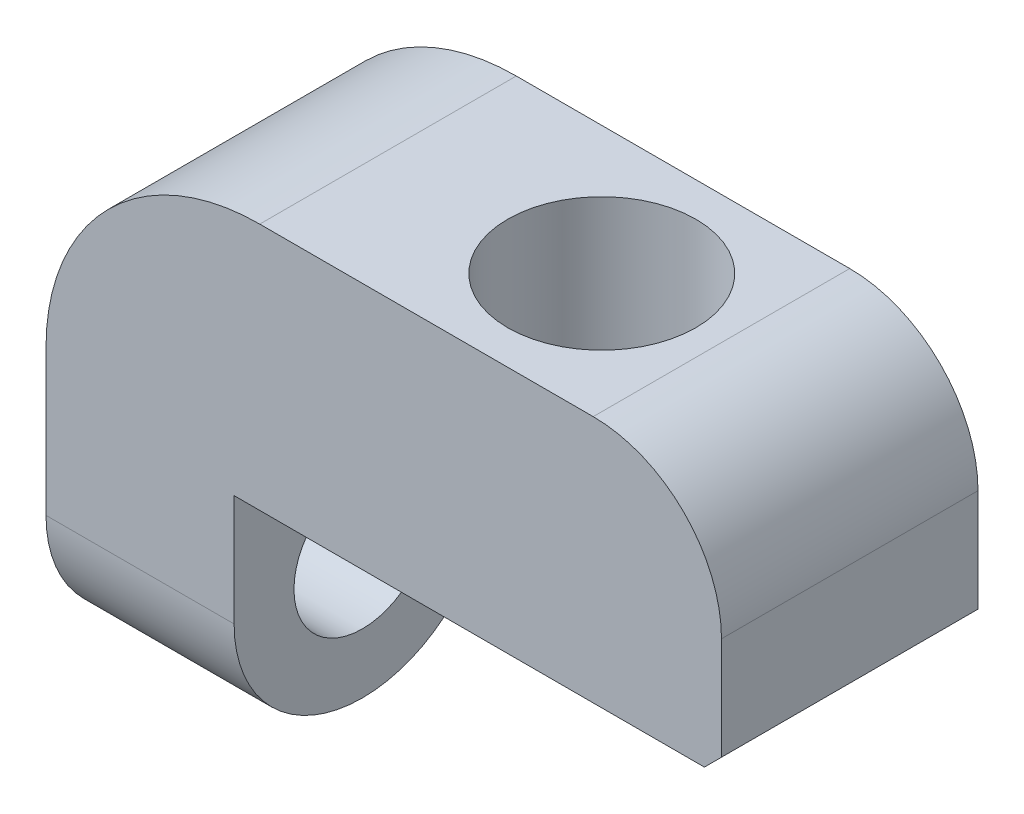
ISO-10303-21;
HEADER;
FILE_DESCRIPTION(('STEP AP214'),'2;1');
FILE_NAME('part.step','',(''),(''),'','','');
FILE_SCHEMA(('AUTOMOTIVE_DESIGN { 1 0 10303 214 1 1 1 1 }'));
ENDSEC;
DATA;
#1=APPLICATION_CONTEXT('core data for automotive mechanical design processes');
#2=APPLICATION_PROTOCOL_DEFINITION('international standard','automotive_design',2000,#1);
#3=PRODUCT_CONTEXT('',#1,'mechanical');
#4=PRODUCT('Part','Part','',(#3));
#5=PRODUCT_RELATED_PRODUCT_CATEGORY('part','',(#4));
#6=PRODUCT_DEFINITION_FORMATION('','',#4);
#7=PRODUCT_DEFINITION_CONTEXT('part definition',#1,'design');
#8=PRODUCT_DEFINITION('design','',#6,#7);
#9=PRODUCT_DEFINITION_SHAPE('','',#8);
#10=(LENGTH_UNIT() NAMED_UNIT(*) SI_UNIT(.MILLI.,.METRE.));
#11=(NAMED_UNIT(*) PLANE_ANGLE_UNIT() SI_UNIT($,.RADIAN.));
#12=(NAMED_UNIT(*) SI_UNIT($,.STERADIAN.) SOLID_ANGLE_UNIT());
#13=UNCERTAINTY_MEASURE_WITH_UNIT(LENGTH_MEASURE(1.E-05),#10,'distance_accuracy_value','');
#14=(GEOMETRIC_REPRESENTATION_CONTEXT(3) GLOBAL_UNCERTAINTY_ASSIGNED_CONTEXT((#13)) GLOBAL_UNIT_ASSIGNED_CONTEXT((#10,
#11,#12)) REPRESENTATION_CONTEXT('',''));
#15=CARTESIAN_POINT('',(0.,0.,0.));
#16=DIRECTION('',(0.,0.,1.));
#17=DIRECTION('',(1.,0.,0.));
#18=AXIS2_PLACEMENT_3D('',#15,#16,#17);
#19=CARTESIAN_POINT('',(65.5,31.5,24.));
#20=DIRECTION('',(0.,1.,0.));
#21=DIRECTION('',(0.,0.,1.));
#22=AXIS2_PLACEMENT_3D('',#19,#20,#21);
#23=PLANE('',#22);
#24=CARTESIAN_POINT('',(68.,31.5,24.));
#25=DIRECTION('',(0.,-1.,0.));
#26=DIRECTION('',(0.,0.,-1.));
#27=AXIS2_PLACEMENT_3D('',#24,#25,#26);
#28=CIRCLE('',#27,3.5);
#29=CARTESIAN_POINT('',(68.,31.5,20.5));
#30=VERTEX_POINT('',#29);
#31=EDGE_CURVE('E155',#30,#30,#28,.T.);
#32=ORIENTED_EDGE('',*,*,#31,.F.);
#33=EDGE_LOOP('',(#32));
#34=FACE_BOUND('',#33,.T.);
#35=CARTESIAN_POINT('',(51.,31.5,24.));
#36=DIRECTION('',(0.,-1.,0.));
#37=DIRECTION('',(0.,0.,-1.));
#38=AXIS2_PLACEMENT_3D('',#35,#36,#37);
#39=CIRCLE('',#38,11.);
#40=CARTESIAN_POINT('',(51.,31.5,13.));
#41=VERTEX_POINT('',#40);
#42=CARTESIAN_POINT('',(51.,31.5,35.));
#43=VERTEX_POINT('',#42);
#44=EDGE_CURVE('E165',#41,#43,#39,.T.);
#45=ORIENTED_EDGE('',*,*,#44,.F.);
#46=DIRECTION('',(1.,0.,0.));
#47=VECTOR('',#46,1.);
#48=CARTESIAN_POINT('',(65.5,31.5,13.));
#49=LINE('',#48,#47);
#50=CARTESIAN_POINT('',(65.5,31.5,13.));
#51=VERTEX_POINT('',#50);
#52=EDGE_CURVE('E191',#41,#51,#49,.T.);
#53=ORIENTED_EDGE('',*,*,#52,.T.);
#54=CARTESIAN_POINT('',(65.5,31.5,24.));
#55=DIRECTION('',(0.,-1.,0.));
#56=DIRECTION('',(0.,0.,1.));
#57=AXIS2_PLACEMENT_3D('',#54,#55,#56);
#58=CIRCLE('',#57,11.);
#59=CARTESIAN_POINT('',(65.5,31.5,35.));
#60=VERTEX_POINT('',#59);
#61=EDGE_CURVE('E181',#51,#60,#58,.T.);
#62=ORIENTED_EDGE('',*,*,#61,.T.);
#63=DIRECTION('',(-1.,0.,0.));
#64=VECTOR('',#63,1.);
#65=CARTESIAN_POINT('',(65.5,31.5,35.));
#66=LINE('',#65,#64);
#67=EDGE_CURVE('E185',#60,#43,#66,.T.);
#68=ORIENTED_EDGE('',*,*,#67,.T.);
#69=EDGE_LOOP('',(#45,#53,#62,#68));
#70=FACE_BOUND('',#69,.T.);
#71=ADVANCED_FACE('F29',(#34,#70),#23,.F.);
#72=CARTESIAN_POINT('',(34.,31.5,24.));
#73=DIRECTION('',(0.,-1.,0.));
#74=DIRECTION('',(0.,0.,-1.));
#75=AXIS2_PLACEMENT_3D('',#72,#73,#74);
#76=CIRCLE('',#75,3.5);
#77=CARTESIAN_POINT('',(34.,31.5,20.5));
#78=VERTEX_POINT('',#77);
#79=EDGE_CURVE('E148',#78,#78,#76,.T.);
#80=ORIENTED_EDGE('',*,*,#79,.F.);
#81=EDGE_LOOP('',(#80));
#82=FACE_BOUND('',#81,.T.);
#83=EDGE_CURVE('E164',#43,#41,#39,.T.);
#84=ORIENTED_EDGE('',*,*,#83,.F.);
#85=CARTESIAN_POINT('',(36.5,31.5,35.));
#86=VERTEX_POINT('',#85);
#87=EDGE_CURVE('E184',#43,#86,#66,.T.);
#88=ORIENTED_EDGE('',*,*,#87,.T.);
#89=CARTESIAN_POINT('',(36.5,31.5,24.));
#90=DIRECTION('',(0.,-1.,0.));
#91=DIRECTION('',(0.,0.,-1.));
#92=AXIS2_PLACEMENT_3D('',#89,#90,#91);
#93=CIRCLE('',#92,11.);
#94=CARTESIAN_POINT('',(36.5,31.5,13.));
#95=VERTEX_POINT('',#94);
#96=EDGE_CURVE('E188',#86,#95,#93,.T.);
#97=ORIENTED_EDGE('',*,*,#96,.T.);
#98=EDGE_CURVE('E192',#95,#41,#49,.T.);
#99=ORIENTED_EDGE('',*,*,#98,.T.);
#100=EDGE_LOOP('',(#84,#88,#97,#99));
#101=FACE_BOUND('',#100,.T.);
#102=ADVANCED_FACE('F311',(#82,#101),#23,.F.);
#103=CARTESIAN_POINT('',(-134.664238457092,60.7958037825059,9.));
#104=DIRECTION('',(0.,0.,1.));
#105=DIRECTION('',(0.,-1.,0.));
#106=AXIS2_PLACEMENT_3D('',#103,#104,#105);
#107=PLANE('',#106);
#108=DIRECTION('',(0.,-1.,0.));
#109=VECTOR('',#108,1.);
#110=CARTESIAN_POINT('',(80.,0.999999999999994,9.00000000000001));
#111=LINE('',#110,#109);
#112=CARTESIAN_POINT('',(80.,42.9999999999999,9.00000000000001));
#113=VERTEX_POINT('',#112);
#114=CARTESIAN_POINT('',(80.,31.,9.00000000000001));
#115=VERTEX_POINT('',#114);
#116=EDGE_CURVE('E242',#113,#115,#111,.T.);
#117=ORIENTED_EDGE('',*,*,#116,.T.);
#118=DIRECTION('',(-0.707106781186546,-0.707106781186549,0.));
#119=VECTOR('',#118,1.);
#120=CARTESIAN_POINT('',(78.,29.,9.00000000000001));
#121=LINE('',#120,#119);
#122=CARTESIAN_POINT('',(78.,29.,9.00000000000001));
#123=VERTEX_POINT('',#122);
#124=EDGE_CURVE('E12',#115,#123,#121,.T.);
#125=ORIENTED_EDGE('',*,*,#124,.T.);
#126=DIRECTION('',(1.,0.,0.));
#127=VECTOR('',#126,1.);
#128=CARTESIAN_POINT('',(82.2408482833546,29.,9.00000000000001));
#129=LINE('',#128,#127);
#130=CARTESIAN_POINT('',(23.,29.,9.00000000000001));
#131=VERTEX_POINT('',#130);
#132=EDGE_CURVE('E206',#131,#123,#129,.T.);
#133=ORIENTED_EDGE('',*,*,#132,.F.);
#134=DIRECTION('',(0.,1.,0.));
#135=VECTOR('',#134,1.);
#136=CARTESIAN_POINT('',(23.,-4.15393061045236,9.00000000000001));
#137=LINE('',#136,#135);
#138=CARTESIAN_POINT('',(23.,16.,9.00000000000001));
#139=VERTEX_POINT('',#138);
#140=EDGE_CURVE('E198',#139,#131,#137,.T.);
#141=ORIENTED_EDGE('',*,*,#140,.F.);
#142=DIRECTION('',(-1.,0.,0.));
#143=VECTOR('',#142,1.);
#144=CARTESIAN_POINT('',(1.,16.,9.00000000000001));
#145=LINE('',#144,#143);
#146=CARTESIAN_POINT('',(1.00000000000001,16.,9.00000000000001));
#147=VERTEX_POINT('',#146);
#148=EDGE_CURVE('E252',#139,#147,#145,.T.);
#149=ORIENTED_EDGE('',*,*,#148,.T.);
#150=DIRECTION('',(0.,1.,0.));
#151=VECTOR('',#150,1.);
#152=CARTESIAN_POINT('',(1.,32.9999999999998,9.00000000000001));
#153=LINE('',#152,#151);
#154=CARTESIAN_POINT('',(1.,32.9999999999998,9.00000000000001));
#155=VERTEX_POINT('',#154);
#156=EDGE_CURVE('E223',#147,#155,#153,.T.);
#157=ORIENTED_EDGE('',*,*,#156,.T.);
#158=CARTESIAN_POINT('',(26.,33.,9.00000000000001));
#159=DIRECTION('',(0.,0.,1.));
#160=DIRECTION('',(0.,-1.,0.));
#161=AXIS2_PLACEMENT_3D('',#158,#159,#160);
#162=CIRCLE('',#161,25.);
#163=CARTESIAN_POINT('',(26.0000000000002,58.,9.));
#164=VERTEX_POINT('',#163);
#165=EDGE_CURVE('E220',#155,#164,#162,.F.);
#166=ORIENTED_EDGE('',*,*,#165,.T.);
#167=DIRECTION('',(1.,0.,0.));
#168=VECTOR('',#167,1.);
#169=CARTESIAN_POINT('',(64.9999999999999,58.,9.));
#170=LINE('',#169,#168);
#171=CARTESIAN_POINT('',(64.9999999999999,58.,9.00000000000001));
#172=VERTEX_POINT('',#171);
#173=EDGE_CURVE('E217',#164,#172,#170,.T.);
#174=ORIENTED_EDGE('',*,*,#173,.T.);
#175=CARTESIAN_POINT('',(65.,43.,9.));
#176=DIRECTION('',(0.,0.,1.));
#177=DIRECTION('',(0.,-1.,0.));
#178=AXIS2_PLACEMENT_3D('',#175,#176,#177);
#179=CIRCLE('',#178,15.);
#180=EDGE_CURVE('E214',#172,#113,#179,.F.);
#181=ORIENTED_EDGE('',*,*,#180,.T.);
#182=EDGE_LOOP('',(#117,#125,#133,#141,#149,#157,#166,#174,#181));
#183=FACE_BOUND('',#182,.T.);
#184=ADVANCED_FACE('F298',(#183),#107,.F.);
#185=CARTESIAN_POINT('',(1.,32.9999999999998,8.));
#186=DIRECTION('',(-1.,0.,0.));
#187=DIRECTION('',(0.,-1.,0.));
#188=AXIS2_PLACEMENT_3D('',#185,#186,#187);
#189=PLANE('',#188);
#190=CARTESIAN_POINT('',(1.00000000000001,16.,24.));
#191=DIRECTION('',(-1.,0.,0.));
#192=DIRECTION('',(0.,-1.,0.));
#193=AXIS2_PLACEMENT_3D('',#190,#191,#192);
#194=CIRCLE('',#193,8.);
#195=CARTESIAN_POINT('',(1.00000000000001,7.99999999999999,24.));
#196=VERTEX_POINT('',#195);
#197=EDGE_CURVE('E270',#196,#196,#194,.T.);
#198=ORIENTED_EDGE('',*,*,#197,.F.);
#199=EDGE_LOOP('',(#198));
#200=FACE_BOUND('',#199,.T.);
#201=ORIENTED_EDGE('',*,*,#156,.F.);
#202=CARTESIAN_POINT('',(1.,16.,24.));
#203=DIRECTION('',(-1.,0.,0.));
#204=DIRECTION('',(0.,-1.,0.));
#205=AXIS2_PLACEMENT_3D('',#202,#203,#204);
#206=CIRCLE('',#205,15.);
#207=CARTESIAN_POINT('',(1.00000000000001,0.999999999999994,24.));
#208=VERTEX_POINT('',#207);
#209=EDGE_CURVE('E257',#147,#208,#206,.T.);
#210=ORIENTED_EDGE('',*,*,#209,.T.);
#211=CARTESIAN_POINT('',(1.00000000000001,16.,24.));
#212=DIRECTION('',(-1.,0.,0.));
#213=DIRECTION('',(0.,-1.,0.));
#214=AXIS2_PLACEMENT_3D('',#211,#212,#213);
#215=CIRCLE('',#214,15.);
#216=CARTESIAN_POINT('',(1.00000000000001,16.,39.));
#217=VERTEX_POINT('',#216);
#218=EDGE_CURVE('E255',#208,#217,#215,.T.);
#219=ORIENTED_EDGE('',*,*,#218,.T.);
#220=DIRECTION('',(0.,-1.,0.));
#221=VECTOR('',#220,1.);
#222=CARTESIAN_POINT('',(1.,32.9999999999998,39.));
#223=LINE('',#222,#221);
#224=CARTESIAN_POINT('',(1.,32.9999999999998,39.));
#225=VERTEX_POINT('',#224);
#226=EDGE_CURVE('E236',#225,#217,#223,.T.);
#227=ORIENTED_EDGE('',*,*,#226,.F.);
#228=DIRECTION('',(0.,0.,1.));
#229=VECTOR('',#228,1.);
#230=CARTESIAN_POINT('',(1.,32.9999999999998,8.));
#231=LINE('',#230,#229);
#232=EDGE_CURVE('E240',#155,#225,#231,.T.);
#233=ORIENTED_EDGE('',*,*,#232,.F.);
#234=EDGE_LOOP('',(#201,#210,#219,#227,#233));
#235=FACE_BOUND('',#234,.T.);
#236=ADVANCED_FACE('F348',(#200,#235),#189,.T.);
#237=CARTESIAN_POINT('',(26.,33.,8.));
#238=DIRECTION('',(0.,0.,1.));
#239=DIRECTION('',(1.,0.,0.));
#240=AXIS2_PLACEMENT_3D('',#237,#238,#239);
#241=CYLINDRICAL_SURFACE('',#240,25.);
#242=ORIENTED_EDGE('',*,*,#165,.F.);
#243=ORIENTED_EDGE('',*,*,#232,.T.);
#244=CARTESIAN_POINT('',(26.,33.,39.));
#245=DIRECTION('',(0.,0.,1.));
#246=DIRECTION('',(1.,0.,0.));
#247=AXIS2_PLACEMENT_3D('',#244,#245,#246);
#248=CIRCLE('',#247,25.);
#249=CARTESIAN_POINT('',(26.0000000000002,58.,39.));
#250=VERTEX_POINT('',#249);
#251=EDGE_CURVE('E233',#250,#225,#248,.T.);
#252=ORIENTED_EDGE('',*,*,#251,.F.);
#253=DIRECTION('',(0.,0.,1.));
#254=VECTOR('',#253,1.);
#255=CARTESIAN_POINT('',(26.0000000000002,58.,8.));
#256=LINE('',#255,#254);
#257=EDGE_CURVE('E243',#164,#250,#256,.T.);
#258=ORIENTED_EDGE('',*,*,#257,.F.);
#259=EDGE_LOOP('',(#242,#243,#252,#258));
#260=FACE_BOUND('',#259,.T.);
#261=ADVANCED_FACE('F351',(#260),#241,.T.);
#262=CARTESIAN_POINT('',(64.9999999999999,58.,8.));
#263=DIRECTION('',(0.,1.,0.));
#264=DIRECTION('',(-1.,0.,0.));
#265=AXIS2_PLACEMENT_3D('',#262,#263,#264);
#266=PLANE('',#265);
#267=CARTESIAN_POINT('',(51.,58.,24.));
#268=DIRECTION('',(0.,-1.,0.));
#269=DIRECTION('',(0.,0.,-1.));
#270=AXIS2_PLACEMENT_3D('',#267,#268,#269);
#271=CIRCLE('',#270,11.);
#272=CARTESIAN_POINT('',(51.,58.,13.));
#273=VERTEX_POINT('',#272);
#274=EDGE_CURVE('E167',#273,#273,#271,.T.);
#275=ORIENTED_EDGE('',*,*,#274,.T.);
#276=EDGE_LOOP('',(#275));
#277=FACE_BOUND('',#276,.T.);
#278=ORIENTED_EDGE('',*,*,#173,.F.);
#279=ORIENTED_EDGE('',*,*,#257,.T.);
#280=DIRECTION('',(-1.,0.,0.));
#281=VECTOR('',#280,1.);
#282=CARTESIAN_POINT('',(64.9999999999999,58.,39.));
#283=LINE('',#282,#281);
#284=CARTESIAN_POINT('',(64.9999999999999,58.,39.));
#285=VERTEX_POINT('',#284);
#286=EDGE_CURVE('E230',#285,#250,#283,.T.);
#287=ORIENTED_EDGE('',*,*,#286,.F.);
#288=DIRECTION('',(0.,0.,1.));
#289=VECTOR('',#288,1.);
#290=CARTESIAN_POINT('',(64.9999999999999,58.,8.));
#291=LINE('',#290,#289);
#292=EDGE_CURVE('E245',#172,#285,#291,.T.);
#293=ORIENTED_EDGE('',*,*,#292,.F.);
#294=EDGE_LOOP('',(#278,#279,#287,#293));
#295=FACE_BOUND('',#294,.T.);
#296=ADVANCED_FACE('F355',(#277,#295),#266,.T.);
#297=CARTESIAN_POINT('',(65.,43.,8.));
#298=DIRECTION('',(0.,0.,1.));
#299=DIRECTION('',(1.,0.,0.));
#300=AXIS2_PLACEMENT_3D('',#297,#298,#299);
#301=CYLINDRICAL_SURFACE('',#300,15.);
#302=ORIENTED_EDGE('',*,*,#180,.F.);
#303=ORIENTED_EDGE('',*,*,#292,.T.);
#304=CARTESIAN_POINT('',(65.,43.,39.));
#305=DIRECTION('',(0.,0.,1.));
#306=DIRECTION('',(1.,0.,0.));
#307=AXIS2_PLACEMENT_3D('',#304,#305,#306);
#308=CIRCLE('',#307,15.);
#309=CARTESIAN_POINT('',(80.,42.9999999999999,39.));
#310=VERTEX_POINT('',#309);
#311=EDGE_CURVE('E227',#310,#285,#308,.T.);
#312=ORIENTED_EDGE('',*,*,#311,.F.);
#313=DIRECTION('',(0.,0.,1.));
#314=VECTOR('',#313,1.);
#315=CARTESIAN_POINT('',(80.,42.9999999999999,8.));
#316=LINE('',#315,#314);
#317=EDGE_CURVE('E239',#113,#310,#316,.T.);
#318=ORIENTED_EDGE('',*,*,#317,.F.);
#319=EDGE_LOOP('',(#302,#303,#312,#318));
#320=FACE_BOUND('',#319,.T.);
#321=ADVANCED_FACE('F359',(#320),#301,.T.);
#322=CARTESIAN_POINT('',(80.,0.999999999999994,8.));
#323=DIRECTION('',(1.,0.,0.));
#324=DIRECTION('',(0.,0.,-1.));
#325=AXIS2_PLACEMENT_3D('',#322,#323,#324);
#326=PLANE('',#325);
#327=DIRECTION('',(0.,1.,0.));
#328=VECTOR('',#327,1.);
#329=CARTESIAN_POINT('',(80.,0.999999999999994,39.));
#330=LINE('',#329,#328);
#331=CARTESIAN_POINT('',(80.,31.,39.));
#332=VERTEX_POINT('',#331);
#333=EDGE_CURVE('E225',#332,#310,#330,.T.);
#334=ORIENTED_EDGE('',*,*,#333,.F.);
#335=DIRECTION('',(0.,0.,-1.));
#336=VECTOR('',#335,1.);
#337=CARTESIAN_POINT('',(80.,31.,9.00000000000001));
#338=LINE('',#337,#336);
#339=EDGE_CURVE('E37',#332,#115,#338,.T.);
#340=ORIENTED_EDGE('',*,*,#339,.T.);
#341=ORIENTED_EDGE('',*,*,#116,.F.);
#342=ORIENTED_EDGE('',*,*,#317,.T.);
#343=EDGE_LOOP('',(#334,#340,#341,#342));
#344=FACE_BOUND('',#343,.T.);
#345=ADVANCED_FACE('F362',(#344),#326,.T.);
#346=CARTESIAN_POINT('',(0.,59.,39.));
#347=DIRECTION('',(0.,0.,-1.));
#348=DIRECTION('',(-1.,0.,0.));
#349=AXIS2_PLACEMENT_3D('',#346,#347,#348);
#350=PLANE('',#349);
#351=DIRECTION('',(1.,0.,0.));
#352=VECTOR('',#351,1.);
#353=CARTESIAN_POINT('',(82.2408482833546,29.,39.));
#354=LINE('',#353,#352);
#355=CARTESIAN_POINT('',(23.,29.,39.));
#356=VERTEX_POINT('',#355);
#357=CARTESIAN_POINT('',(78.,29.,39.));
#358=VERTEX_POINT('',#357);
#359=EDGE_CURVE('E209',#356,#358,#354,.T.);
#360=ORIENTED_EDGE('',*,*,#359,.T.);
#361=DIRECTION('',(0.707106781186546,0.707106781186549,0.));
#362=VECTOR('',#361,1.);
#363=CARTESIAN_POINT('',(78.,29.,39.));
#364=LINE('',#363,#362);
#365=EDGE_CURVE('E51',#358,#332,#364,.T.);
#366=ORIENTED_EDGE('',*,*,#365,.T.);
#367=ORIENTED_EDGE('',*,*,#333,.T.);
#368=ORIENTED_EDGE('',*,*,#311,.T.);
#369=ORIENTED_EDGE('',*,*,#286,.T.);
#370=ORIENTED_EDGE('',*,*,#251,.T.);
#371=ORIENTED_EDGE('',*,*,#226,.T.);
#372=DIRECTION('',(1.,0.,0.));
#373=VECTOR('',#372,1.);
#374=CARTESIAN_POINT('',(23.,16.,39.));
#375=LINE('',#374,#373);
#376=CARTESIAN_POINT('',(23.,16.,39.));
#377=VERTEX_POINT('',#376);
#378=EDGE_CURVE('E263',#217,#377,#375,.T.);
#379=ORIENTED_EDGE('',*,*,#378,.T.);
#380=DIRECTION('',(0.,1.,0.));
#381=VECTOR('',#380,1.);
#382=CARTESIAN_POINT('',(23.,59.,39.));
#383=LINE('',#382,#381);
#384=EDGE_CURVE('E250',#377,#356,#383,.T.);
#385=ORIENTED_EDGE('',*,*,#384,.T.);
#386=EDGE_LOOP('',(#360,#366,#367,#368,#369,#370,#371,#379,#385));
#387=FACE_BOUND('',#386,.T.);
#388=ADVANCED_FACE('F31',(#387),#350,.F.);
#389=CARTESIAN_POINT('',(82.2408482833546,29.,39.));
#390=DIRECTION('',(0.,1.,0.));
#391=DIRECTION('',(0.,0.,1.));
#392=AXIS2_PLACEMENT_3D('',#389,#390,#391);
#393=PLANE('',#392);
#394=DIRECTION('',(-1.,0.,0.));
#395=VECTOR('',#394,1.);
#396=CARTESIAN_POINT('',(65.5,29.,35.));
#397=LINE('',#396,#395);
#398=CARTESIAN_POINT('',(65.5,29.,35.));
#399=VERTEX_POINT('',#398);
#400=CARTESIAN_POINT('',(36.5,29.,35.));
#401=VERTEX_POINT('',#400);
#402=EDGE_CURVE('E172',#399,#401,#397,.T.);
#403=ORIENTED_EDGE('',*,*,#402,.F.);
#404=CARTESIAN_POINT('',(65.5,29.,24.));
#405=DIRECTION('',(0.,-1.,0.));
#406=DIRECTION('',(0.,0.,1.));
#407=AXIS2_PLACEMENT_3D('',#404,#405,#406);
#408=CIRCLE('',#407,11.);
#409=CARTESIAN_POINT('',(65.5,29.,13.));
#410=VERTEX_POINT('',#409);
#411=EDGE_CURVE('E170',#410,#399,#408,.T.);
#412=ORIENTED_EDGE('',*,*,#411,.F.);
#413=DIRECTION('',(1.,0.,0.));
#414=VECTOR('',#413,1.);
#415=CARTESIAN_POINT('',(65.5,29.,13.));
#416=LINE('',#415,#414);
#417=CARTESIAN_POINT('',(36.5,29.,13.));
#418=VERTEX_POINT('',#417);
#419=EDGE_CURVE('E178',#418,#410,#416,.T.);
#420=ORIENTED_EDGE('',*,*,#419,.F.);
#421=CARTESIAN_POINT('',(36.5,29.,24.));
#422=DIRECTION('',(0.,-1.,0.));
#423=DIRECTION('',(0.,0.,-1.));
#424=AXIS2_PLACEMENT_3D('',#421,#422,#423);
#425=CIRCLE('',#424,11.);
#426=EDGE_CURVE('E175',#401,#418,#425,.T.);
#427=ORIENTED_EDGE('',*,*,#426,.F.);
#428=EDGE_LOOP('',(#403,#412,#420,#427));
#429=FACE_BOUND('',#428,.T.);
#430=ORIENTED_EDGE('',*,*,#132,.T.);
#431=DIRECTION('',(0.,0.,1.));
#432=VECTOR('',#431,1.);
#433=CARTESIAN_POINT('',(78.,29.,39.));
#434=LINE('',#433,#432);
#435=EDGE_CURVE('E265',#123,#358,#434,.T.);
#436=ORIENTED_EDGE('',*,*,#435,.T.);
#437=ORIENTED_EDGE('',*,*,#359,.F.);
#438=DIRECTION('',(0.,0.,-1.));
#439=VECTOR('',#438,1.);
#440=CARTESIAN_POINT('',(23.,29.,39.));
#441=LINE('',#440,#439);
#442=EDGE_CURVE('E211',#356,#131,#441,.T.);
#443=ORIENTED_EDGE('',*,*,#442,.T.);
#444=EDGE_LOOP('',(#430,#436,#437,#443));
#445=FACE_BOUND('',#444,.T.);
#446=ADVANCED_FACE('F276',(#429,#445),#393,.F.);
#447=CARTESIAN_POINT('',(23.,-4.15393061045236,39.));
#448=DIRECTION('',(-1.,0.,0.));
#449=DIRECTION('',(0.,0.,1.));
#450=AXIS2_PLACEMENT_3D('',#447,#448,#449);
#451=PLANE('',#450);
#452=CARTESIAN_POINT('',(23.,16.,24.));
#453=DIRECTION('',(-1.,0.,0.));
#454=DIRECTION('',(0.,0.,1.));
#455=AXIS2_PLACEMENT_3D('',#452,#453,#454);
#456=CIRCLE('',#455,8.);
#457=CARTESIAN_POINT('',(23.,16.,32.));
#458=VERTEX_POINT('',#457);
#459=EDGE_CURVE('E266',#458,#458,#456,.T.);
#460=ORIENTED_EDGE('',*,*,#459,.T.);
#461=EDGE_LOOP('',(#460));
#462=FACE_BOUND('',#461,.T.);
#463=CARTESIAN_POINT('',(23.,16.,24.));
#464=DIRECTION('',(-1.,0.,0.));
#465=DIRECTION('',(0.,0.,1.));
#466=AXIS2_PLACEMENT_3D('',#463,#464,#465);
#467=CIRCLE('',#466,15.);
#468=CARTESIAN_POINT('',(23.,0.999999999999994,24.));
#469=VERTEX_POINT('',#468);
#470=EDGE_CURVE('E259',#377,#469,#467,.F.);
#471=ORIENTED_EDGE('',*,*,#470,.T.);
#472=CARTESIAN_POINT('',(23.,16.,24.));
#473=DIRECTION('',(-1.,0.,0.));
#474=DIRECTION('',(0.,0.,1.));
#475=AXIS2_PLACEMENT_3D('',#472,#473,#474);
#476=CIRCLE('',#475,15.);
#477=EDGE_CURVE('E261',#469,#139,#476,.F.);
#478=ORIENTED_EDGE('',*,*,#477,.T.);
#479=ORIENTED_EDGE('',*,*,#140,.T.);
#480=ORIENTED_EDGE('',*,*,#442,.F.);
#481=ORIENTED_EDGE('',*,*,#384,.F.);
#482=EDGE_LOOP('',(#471,#478,#479,#480,#481));
#483=FACE_BOUND('',#482,.T.);
#484=ADVANCED_FACE('F285',(#462,#483),#451,.F.);
#485=CARTESIAN_POINT('',(65.5,31.5,24.));
#486=DIRECTION('',(0.,-1.,0.));
#487=DIRECTION('',(0.,0.,-1.));
#488=AXIS2_PLACEMENT_3D('',#485,#486,#487);
#489=CYLINDRICAL_SURFACE('',#488,11.);
#490=ORIENTED_EDGE('',*,*,#411,.T.);
#491=DIRECTION('',(0.,-1.,0.));
#492=VECTOR('',#491,1.);
#493=CARTESIAN_POINT('',(65.5,31.5,35.));
#494=LINE('',#493,#492);
#495=EDGE_CURVE('E195',#60,#399,#494,.T.);
#496=ORIENTED_EDGE('',*,*,#495,.F.);
#497=ORIENTED_EDGE('',*,*,#61,.F.);
#498=DIRECTION('',(0.,-1.,0.));
#499=VECTOR('',#498,1.);
#500=CARTESIAN_POINT('',(65.5,31.5,13.));
#501=LINE('',#500,#499);
#502=EDGE_CURVE('E196',#51,#410,#501,.T.);
#503=ORIENTED_EDGE('',*,*,#502,.T.);
#504=EDGE_LOOP('',(#490,#496,#497,#503));
#505=FACE_BOUND('',#504,.T.);
#506=ADVANCED_FACE('F329',(#505),#489,.F.);
#507=CARTESIAN_POINT('',(65.5,31.5,13.));
#508=DIRECTION('',(0.,0.,-1.));
#509=DIRECTION('',(-1.,0.,0.));
#510=AXIS2_PLACEMENT_3D('',#507,#508,#509);
#511=PLANE('',#510);
#512=ORIENTED_EDGE('',*,*,#419,.T.);
#513=ORIENTED_EDGE('',*,*,#502,.F.);
#514=ORIENTED_EDGE('',*,*,#52,.F.);
#515=ORIENTED_EDGE('',*,*,#98,.F.);
#516=DIRECTION('',(0.,-1.,0.));
#517=VECTOR('',#516,1.);
#518=CARTESIAN_POINT('',(36.5,31.5,13.));
#519=LINE('',#518,#517);
#520=EDGE_CURVE('E199',#95,#418,#519,.T.);
#521=ORIENTED_EDGE('',*,*,#520,.T.);
#522=EDGE_LOOP('',(#512,#513,#514,#515,#521));
#523=FACE_BOUND('',#522,.T.);
#524=ADVANCED_FACE('F325',(#523),#511,.F.);
#525=CARTESIAN_POINT('',(36.5,31.5,24.));
#526=DIRECTION('',(0.,-1.,0.));
#527=DIRECTION('',(0.,0.,-1.));
#528=AXIS2_PLACEMENT_3D('',#525,#526,#527);
#529=CYLINDRICAL_SURFACE('',#528,11.);
#530=ORIENTED_EDGE('',*,*,#426,.T.);
#531=ORIENTED_EDGE('',*,*,#520,.F.);
#532=ORIENTED_EDGE('',*,*,#96,.F.);
#533=DIRECTION('',(0.,-1.,0.));
#534=VECTOR('',#533,1.);
#535=CARTESIAN_POINT('',(36.5,31.5,35.));
#536=LINE('',#535,#534);
#537=EDGE_CURVE('E201',#86,#401,#536,.T.);
#538=ORIENTED_EDGE('',*,*,#537,.T.);
#539=EDGE_LOOP('',(#530,#531,#532,#538));
#540=FACE_BOUND('',#539,.T.);
#541=ADVANCED_FACE('F328',(#540),#529,.F.);
#542=CARTESIAN_POINT('',(65.5,31.5,35.));
#543=DIRECTION('',(0.,0.,1.));
#544=DIRECTION('',(1.,0.,0.));
#545=AXIS2_PLACEMENT_3D('',#542,#543,#544);
#546=PLANE('',#545);
#547=ORIENTED_EDGE('',*,*,#402,.T.);
#548=ORIENTED_EDGE('',*,*,#537,.F.);
#549=ORIENTED_EDGE('',*,*,#87,.F.);
#550=ORIENTED_EDGE('',*,*,#67,.F.);
#551=ORIENTED_EDGE('',*,*,#495,.T.);
#552=EDGE_LOOP('',(#547,#548,#549,#550,#551));
#553=FACE_BOUND('',#552,.T.);
#554=ADVANCED_FACE('F333',(#553),#546,.F.);
#555=CARTESIAN_POINT('',(51.,58.,24.));
#556=DIRECTION('',(0.,-1.,0.));
#557=DIRECTION('',(0.,0.,-1.));
#558=AXIS2_PLACEMENT_3D('',#555,#556,#557);
#559=CYLINDRICAL_SURFACE('',#558,11.);
#560=ORIENTED_EDGE('',*,*,#274,.F.);
#561=EDGE_LOOP('',(#560));
#562=FACE_BOUND('',#561,.T.);
#563=ORIENTED_EDGE('',*,*,#44,.T.);
#564=ORIENTED_EDGE('',*,*,#83,.T.);
#565=EDGE_LOOP('',(#563,#564));
#566=FACE_BOUND('',#565,.T.);
#567=ADVANCED_FACE('F323',(#562,#566),#559,.F.);
#568=CARTESIAN_POINT('',(34.,48.6,24.));
#569=DIRECTION('',(0.,-1.,0.));
#570=DIRECTION('',(0.,0.,-1.));
#571=AXIS2_PLACEMENT_3D('',#568,#569,#570);
#572=CONICAL_SURFACE('',#571,1.64999999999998,1.02974425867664);
#573=CARTESIAN_POINT('',(34.,49.5914200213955,24.));
#574=VERTEX_POINT('',#573);
#575=VERTEX_LOOP('',#574);
#576=FACE_BOUND('',#575,.T.);
#577=CARTESIAN_POINT('',(34.,48.6,24.));
#578=DIRECTION('',(0.,-1.,0.));
#579=DIRECTION('',(0.,0.,-1.));
#580=AXIS2_PLACEMENT_3D('',#577,#578,#579);
#581=CIRCLE('',#580,1.64999999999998);
#582=CARTESIAN_POINT('',(34.,48.6,22.35));
#583=VERTEX_POINT('',#582);
#584=EDGE_CURVE('E161',#583,#583,#581,.T.);
#585=ORIENTED_EDGE('',*,*,#584,.T.);
#586=EDGE_LOOP('',(#585));
#587=FACE_BOUND('',#586,.T.);
#588=ADVANCED_FACE('F422',(#576,#587),#572,.F.);
#589=CARTESIAN_POINT('',(34.,31.5,24.));
#590=DIRECTION('',(0.,-1.,0.));
#591=DIRECTION('',(0.,0.,-1.));
#592=AXIS2_PLACEMENT_3D('',#589,#590,#591);
#593=CYLINDRICAL_SURFACE('',#592,1.64999999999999);
#594=ORIENTED_EDGE('',*,*,#584,.F.);
#595=EDGE_LOOP('',(#594));
#596=FACE_BOUND('',#595,.T.);
#597=CARTESIAN_POINT('',(34.,33.35,24.));
#598=DIRECTION('',(0.,-1.,0.));
#599=DIRECTION('',(0.,0.,-1.));
#600=AXIS2_PLACEMENT_3D('',#597,#598,#599);
#601=CIRCLE('',#600,1.65);
#602=CARTESIAN_POINT('',(34.,33.35,22.35));
#603=VERTEX_POINT('',#602);
#604=EDGE_CURVE('E152',#603,#603,#601,.T.);
#605=ORIENTED_EDGE('',*,*,#604,.T.);
#606=EDGE_LOOP('',(#605));
#607=FACE_BOUND('',#606,.T.);
#608=ADVANCED_FACE('F428',(#596,#607),#593,.F.);
#609=CARTESIAN_POINT('',(34.,31.5,24.));
#610=DIRECTION('',(0.,-1.,0.));
#611=DIRECTION('',(0.,0.,-1.));
#612=AXIS2_PLACEMENT_3D('',#609,#610,#611);
#613=CONICAL_SURFACE('',#612,3.5,0.78539816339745);
#614=ORIENTED_EDGE('',*,*,#604,.F.);
#615=EDGE_LOOP('',(#614));
#616=FACE_BOUND('',#615,.T.);
#617=ORIENTED_EDGE('',*,*,#79,.T.);
#618=EDGE_LOOP('',(#617));
#619=FACE_BOUND('',#618,.T.);
#620=ADVANCED_FACE('F142',(#616,#619),#613,.F.);
#621=CARTESIAN_POINT('',(68.,48.6,24.));
#622=DIRECTION('',(0.,-1.,0.));
#623=DIRECTION('',(0.,0.,-1.));
#624=AXIS2_PLACEMENT_3D('',#621,#622,#623);
#625=CONICAL_SURFACE('',#624,1.64999999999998,1.02974425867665);
#626=CARTESIAN_POINT('',(68.,49.5914200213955,24.));
#627=VERTEX_POINT('',#626);
#628=VERTEX_LOOP('',#627);
#629=FACE_BOUND('',#628,.T.);
#630=CARTESIAN_POINT('',(68.,48.6,24.));
#631=DIRECTION('',(0.,-1.,0.));
#632=DIRECTION('',(0.,0.,-1.));
#633=AXIS2_PLACEMENT_3D('',#630,#631,#632);
#634=CIRCLE('',#633,1.64999999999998);
#635=CARTESIAN_POINT('',(68.,48.6,22.35));
#636=VERTEX_POINT('',#635);
#637=EDGE_CURVE('E146',#636,#636,#634,.T.);
#638=ORIENTED_EDGE('',*,*,#637,.T.);
#639=EDGE_LOOP('',(#638));
#640=FACE_BOUND('',#639,.T.);
#641=ADVANCED_FACE('F138',(#629,#640),#625,.F.);
#642=CARTESIAN_POINT('',(68.,31.5,24.));
#643=DIRECTION('',(0.,-1.,0.));
#644=DIRECTION('',(0.,0.,-1.));
#645=AXIS2_PLACEMENT_3D('',#642,#643,#644);
#646=CYLINDRICAL_SURFACE('',#645,1.64999999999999);
#647=ORIENTED_EDGE('',*,*,#637,.F.);
#648=EDGE_LOOP('',(#647));
#649=FACE_BOUND('',#648,.T.);
#650=CARTESIAN_POINT('',(68.,33.35,24.));
#651=DIRECTION('',(0.,-1.,0.));
#652=DIRECTION('',(0.,0.,-1.));
#653=AXIS2_PLACEMENT_3D('',#650,#651,#652);
#654=CIRCLE('',#653,1.65);
#655=CARTESIAN_POINT('',(68.,33.35,22.35));
#656=VERTEX_POINT('',#655);
#657=EDGE_CURVE('E149',#656,#656,#654,.T.);
#658=ORIENTED_EDGE('',*,*,#657,.T.);
#659=EDGE_LOOP('',(#658));
#660=FACE_BOUND('',#659,.T.);
#661=ADVANCED_FACE('F141',(#649,#660),#646,.F.);
#662=CARTESIAN_POINT('',(68.,31.5,24.));
#663=DIRECTION('',(0.,-1.,0.));
#664=DIRECTION('',(0.,0.,-1.));
#665=AXIS2_PLACEMENT_3D('',#662,#663,#664);
#666=CONICAL_SURFACE('',#665,3.5,0.78539816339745);
#667=ORIENTED_EDGE('',*,*,#657,.F.);
#668=EDGE_LOOP('',(#667));
#669=FACE_BOUND('',#668,.T.);
#670=ORIENTED_EDGE('',*,*,#31,.T.);
#671=EDGE_LOOP('',(#670));
#672=FACE_BOUND('',#671,.T.);
#673=ADVANCED_FACE('F455',(#669,#672),#666,.F.);
#674=CARTESIAN_POINT('',(0.,16.,24.));
#675=DIRECTION('',(-1.,0.,0.));
#676=DIRECTION('',(0.,0.,1.));
#677=AXIS2_PLACEMENT_3D('',#674,#675,#676);
#678=CYLINDRICAL_SURFACE('',#677,15.);
#679=DIRECTION('',(1.,0.,0.));
#680=VECTOR('',#679,1.);
#681=CARTESIAN_POINT('',(1.00000000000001,0.999999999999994,24.));
#682=LINE('',#681,#680);
#683=EDGE_CURVE('E269',#469,#208,#682,.F.);
#684=ORIENTED_EDGE('',*,*,#683,.F.);
#685=ORIENTED_EDGE('',*,*,#470,.F.);
#686=ORIENTED_EDGE('',*,*,#378,.F.);
#687=ORIENTED_EDGE('',*,*,#218,.F.);
#688=EDGE_LOOP('',(#684,#685,#686,#687));
#689=FACE_BOUND('',#688,.T.);
#690=ADVANCED_FACE('F288',(#689),#678,.T.);
#691=CARTESIAN_POINT('',(-134.664238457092,16.,24.));
#692=DIRECTION('',(1.,0.,0.));
#693=DIRECTION('',(0.,0.,-1.));
#694=AXIS2_PLACEMENT_3D('',#691,#692,#693);
#695=CYLINDRICAL_SURFACE('',#694,15.);
#696=ORIENTED_EDGE('',*,*,#477,.F.);
#697=ORIENTED_EDGE('',*,*,#683,.T.);
#698=ORIENTED_EDGE('',*,*,#209,.F.);
#699=ORIENTED_EDGE('',*,*,#148,.F.);
#700=EDGE_LOOP('',(#696,#697,#698,#699));
#701=FACE_BOUND('',#700,.T.);
#702=ADVANCED_FACE('F295',(#701),#695,.T.);
#703=CARTESIAN_POINT('',(80.,16.,24.));
#704=DIRECTION('',(-1.,0.,0.));
#705=DIRECTION('',(0.,-1.,0.));
#706=AXIS2_PLACEMENT_3D('',#703,#704,#705);
#707=CYLINDRICAL_SURFACE('',#706,8.);
#708=ORIENTED_EDGE('',*,*,#197,.T.);
#709=EDGE_LOOP('',(#708));
#710=FACE_BOUND('',#709,.T.);
#711=ORIENTED_EDGE('',*,*,#459,.F.);
#712=EDGE_LOOP('',(#711));
#713=FACE_BOUND('',#712,.T.);
#714=ADVANCED_FACE('F302',(#710,#713),#707,.F.);
#715=CARTESIAN_POINT('',(78.,29.,39.));
#716=DIRECTION('',(0.707106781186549,-0.707106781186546,0.));
#717=DIRECTION('',(0.707106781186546,0.707106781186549,0.));
#718=AXIS2_PLACEMENT_3D('',#715,#716,#717);
#719=PLANE('',#718);
#720=ORIENTED_EDGE('',*,*,#124,.F.);
#721=ORIENTED_EDGE('',*,*,#339,.F.);
#722=ORIENTED_EDGE('',*,*,#365,.F.);
#723=ORIENTED_EDGE('',*,*,#435,.F.);
#724=EDGE_LOOP('',(#720,#721,#722,#723));
#725=FACE_BOUND('',#724,.T.);
#726=ADVANCED_FACE('F300',(#725),#719,.T.);
#727=CLOSED_SHELL('',(#71,#102,#184,#236,#261,#296,#321,#345,#388,#446,#484,#506,#524,#541,#554,
#567,#588,#608,#620,#641,#661,#673,#690,#702,#714,#726));
#728=MANIFOLD_SOLID_BREP('B2',#727);
#729=ADVANCED_BREP_SHAPE_REPRESENTATION('',(#18,#728),#14);
#730=SHAPE_DEFINITION_REPRESENTATION(#9,#729);
ENDSEC;
END-ISO-10303-21;
